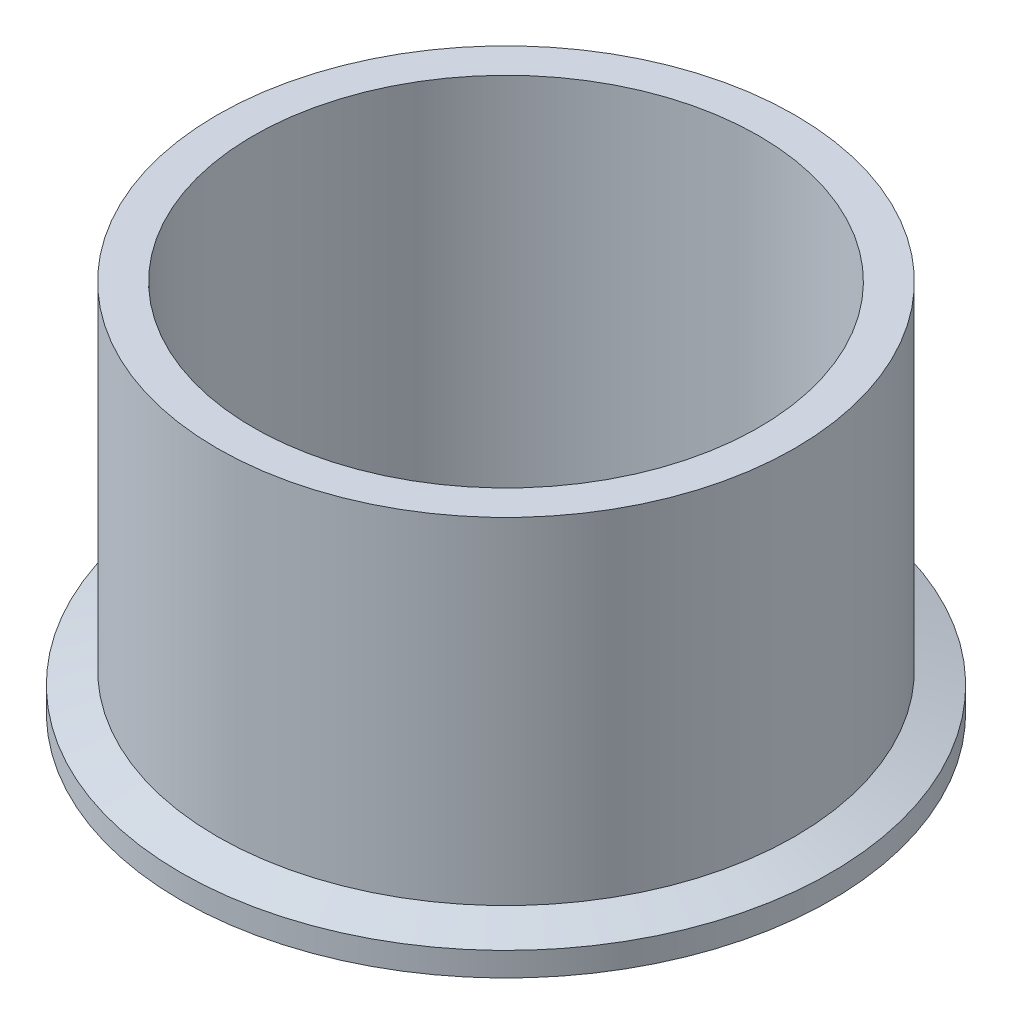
ISO-10303-21;
HEADER;
FILE_DESCRIPTION(('STEP AP214'),'2;1');
FILE_NAME('part.step','',(''),(''),'','','');
FILE_SCHEMA(('AUTOMOTIVE_DESIGN { 1 0 10303 214 1 1 1 1 }'));
ENDSEC;
DATA;
#1=APPLICATION_CONTEXT('core data for automotive mechanical design processes');
#2=APPLICATION_PROTOCOL_DEFINITION('international standard','automotive_design',2000,#1);
#3=PRODUCT_CONTEXT('',#1,'mechanical');
#4=PRODUCT('Part','Part','',(#3));
#5=PRODUCT_RELATED_PRODUCT_CATEGORY('part','',(#4));
#6=PRODUCT_DEFINITION_FORMATION('','',#4);
#7=PRODUCT_DEFINITION_CONTEXT('part definition',#1,'design');
#8=PRODUCT_DEFINITION('design','',#6,#7);
#9=PRODUCT_DEFINITION_SHAPE('','',#8);
#10=(LENGTH_UNIT() NAMED_UNIT(*) SI_UNIT(.MILLI.,.METRE.));
#11=(NAMED_UNIT(*) PLANE_ANGLE_UNIT() SI_UNIT($,.RADIAN.));
#12=(NAMED_UNIT(*) SI_UNIT($,.STERADIAN.) SOLID_ANGLE_UNIT());
#13=UNCERTAINTY_MEASURE_WITH_UNIT(LENGTH_MEASURE(1.E-05),#10,'distance_accuracy_value','');
#14=(GEOMETRIC_REPRESENTATION_CONTEXT(3) GLOBAL_UNCERTAINTY_ASSIGNED_CONTEXT((#13)) GLOBAL_UNIT_ASSIGNED_CONTEXT((#10,
#11,#12)) REPRESENTATION_CONTEXT('',''));
#15=CARTESIAN_POINT('',(0.,0.,0.));
#16=DIRECTION('',(0.,0.,1.));
#17=DIRECTION('',(1.,0.,0.));
#18=AXIS2_PLACEMENT_3D('',#15,#16,#17);
#19=CARTESIAN_POINT('',(0.,0.,0.));
#20=DIRECTION('',(0.,-1.,0.));
#21=DIRECTION('',(0.,0.,-1.));
#22=AXIS2_PLACEMENT_3D('',#19,#20,#21);
#23=CONICAL_SURFACE('',#22,36.788103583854,0.401425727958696);
#24=CARTESIAN_POINT('',(0.,0.872854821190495,0.));
#25=DIRECTION('',(0.,-1.,0.));
#26=DIRECTION('',(0.,0.,-1.));
#27=AXIS2_PLACEMENT_3D('',#24,#25,#26);
#28=CIRCLE('',#27,36.4175986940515);
#29=CARTESIAN_POINT('',(0.,0.872854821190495,-36.4175986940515));
#30=VERTEX_POINT('',#29);
#31=EDGE_CURVE('E10',#30,#30,#28,.T.);
#32=ORIENTED_EDGE('',*,*,#31,.F.);
#33=EDGE_LOOP('',(#32));
#34=FACE_BOUND('',#33,.T.);
#35=CARTESIAN_POINT('',(0.,0.,0.));
#36=DIRECTION('',(0.,-1.,0.));
#37=DIRECTION('',(0.,0.,-1.));
#38=AXIS2_PLACEMENT_3D('',#35,#36,#37);
#39=CIRCLE('',#38,36.788103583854);
#40=CARTESIAN_POINT('',(0.,0.,-36.788103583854));
#41=VERTEX_POINT('',#40);
#42=EDGE_CURVE('E67',#41,#41,#39,.T.);
#43=ORIENTED_EDGE('',*,*,#42,.T.);
#44=EDGE_LOOP('',(#43));
#45=FACE_BOUND('',#44,.T.);
#46=ADVANCED_FACE('F33',(#34,#45),#23,.F.);
#47=CARTESIAN_POINT('',(0.,0.4064,0.));
#48=DIRECTION('',(0.,-1.,0.));
#49=DIRECTION('',(0.,0.,-1.));
#50=AXIS2_PLACEMENT_3D('',#47,#48,#49);
#51=TOROIDAL_SURFACE('',#50,35.3187,1.1938);
#52=CARTESIAN_POINT('',(0.,0.762227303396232,0.));
#53=DIRECTION('',(0.,-1.,0.));
#54=DIRECTION('',(0.,0.,-1.));
#55=AXIS2_PLACEMENT_3D('',#52,#53,#54);
#56=CIRCLE('',#55,34.1791626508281);
#57=CARTESIAN_POINT('',(0.,0.762227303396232,-34.1791626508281));
#58=VERTEX_POINT('',#57);
#59=EDGE_CURVE('E39',#58,#58,#56,.T.);
#60=ORIENTED_EDGE('',*,*,#59,.F.);
#61=EDGE_LOOP('',(#60));
#62=FACE_BOUND('',#61,.T.);
#63=ORIENTED_EDGE('',*,*,#31,.T.);
#64=EDGE_LOOP('',(#63));
#65=FACE_BOUND('',#64,.T.);
#66=ADVANCED_FACE('F114',(#62,#65),#51,.F.);
#67=CARTESIAN_POINT('',(0.,0.762227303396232,0.));
#68=DIRECTION('',(0.,1.,0.));
#69=DIRECTION('',(0.,0.,1.));
#70=AXIS2_PLACEMENT_3D('',#67,#68,#69);
#71=CONICAL_SURFACE('',#70,34.1791626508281,0.401425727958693);
#72=CARTESIAN_POINT('',(0.,0.,0.));
#73=DIRECTION('',(0.,-1.,0.));
#74=DIRECTION('',(0.,0.,-1.));
#75=AXIS2_PLACEMENT_3D('',#72,#73,#74);
#76=CIRCLE('',#75,33.855616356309);
#77=CARTESIAN_POINT('',(0.,0.,-33.855616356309));
#78=VERTEX_POINT('',#77);
#79=EDGE_CURVE('E43',#78,#78,#76,.T.);
#80=ORIENTED_EDGE('',*,*,#79,.F.);
#81=EDGE_LOOP('',(#80));
#82=FACE_BOUND('',#81,.T.);
#83=ORIENTED_EDGE('',*,*,#59,.T.);
#84=EDGE_LOOP('',(#83));
#85=FACE_BOUND('',#84,.T.);
#86=ADVANCED_FACE('F110',(#82,#85),#71,.T.);
#87=CARTESIAN_POINT('',(0.,0.,0.));
#88=DIRECTION('',(0.,1.,0.));
#89=DIRECTION('',(0.,0.,1.));
#90=AXIS2_PLACEMENT_3D('',#87,#88,#89);
#91=PLANE('',#90);
#92=CARTESIAN_POINT('',(0.,0.,0.));
#93=DIRECTION('',(0.,-1.,0.));
#94=DIRECTION('',(0.,0.,-1.));
#95=AXIS2_PLACEMENT_3D('',#92,#93,#94);
#96=CIRCLE('',#95,30.099);
#97=CARTESIAN_POINT('',(0.,0.,-30.099));
#98=VERTEX_POINT('',#97);
#99=EDGE_CURVE('E47',#98,#98,#96,.T.);
#100=ORIENTED_EDGE('',*,*,#99,.F.);
#101=EDGE_LOOP('',(#100));
#102=FACE_BOUND('',#101,.T.);
#103=ORIENTED_EDGE('',*,*,#79,.T.);
#104=EDGE_LOOP('',(#103));
#105=FACE_BOUND('',#104,.T.);
#106=ADVANCED_FACE('F104',(#102,#105),#91,.F.);
#107=CARTESIAN_POINT('',(0.,0.,0.));
#108=DIRECTION('',(0.,-1.,0.));
#109=DIRECTION('',(0.,0.,-1.));
#110=AXIS2_PLACEMENT_3D('',#107,#108,#109);
#111=CYLINDRICAL_SURFACE('',#110,30.099);
#112=ORIENTED_EDGE('',*,*,#99,.T.);
#113=EDGE_LOOP('',(#112));
#114=FACE_BOUND('',#113,.T.);
#115=CARTESIAN_POINT('',(0.,44.45,0.));
#116=DIRECTION('',(0.,-1.,0.));
#117=DIRECTION('',(0.,0.,-1.));
#118=AXIS2_PLACEMENT_3D('',#115,#116,#117);
#119=CIRCLE('',#118,30.099);
#120=CARTESIAN_POINT('',(0.,44.45,-30.099));
#121=VERTEX_POINT('',#120);
#122=EDGE_CURVE('E52',#121,#121,#119,.T.);
#123=ORIENTED_EDGE('',*,*,#122,.F.);
#124=EDGE_LOOP('',(#123));
#125=FACE_BOUND('',#124,.T.);
#126=ADVANCED_FACE('F99',(#114,#125),#111,.F.);
#127=CARTESIAN_POINT('',(0.,44.45,0.));
#128=DIRECTION('',(0.,-1.,0.));
#129=DIRECTION('',(0.,0.,-1.));
#130=AXIS2_PLACEMENT_3D('',#127,#128,#129);
#131=PLANE('',#130);
#132=CARTESIAN_POINT('',(0.,44.45,0.));
#133=DIRECTION('',(0.,-1.,0.));
#134=DIRECTION('',(0.,0.,-1.));
#135=AXIS2_PLACEMENT_3D('',#132,#133,#134);
#136=CIRCLE('',#135,34.3916);
#137=CARTESIAN_POINT('',(0.,44.45,-34.3916));
#138=VERTEX_POINT('',#137);
#139=EDGE_CURVE('E55',#138,#138,#136,.T.);
#140=ORIENTED_EDGE('',*,*,#139,.F.);
#141=EDGE_LOOP('',(#140));
#142=FACE_BOUND('',#141,.T.);
#143=ORIENTED_EDGE('',*,*,#122,.T.);
#144=EDGE_LOOP('',(#143));
#145=FACE_BOUND('',#144,.T.);
#146=ADVANCED_FACE('F93',(#142,#145),#131,.F.);
#147=CARTESIAN_POINT('',(0.,0.,0.));
#148=DIRECTION('',(0.,-1.,0.));
#149=DIRECTION('',(0.,0.,-1.));
#150=AXIS2_PLACEMENT_3D('',#147,#148,#149);
#151=CYLINDRICAL_SURFACE('',#150,34.3916);
#152=CARTESIAN_POINT('',(0.,4.41642347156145,0.));
#153=DIRECTION('',(0.,-1.,0.));
#154=DIRECTION('',(0.,0.,-1.));
#155=AXIS2_PLACEMENT_3D('',#152,#153,#154);
#156=CIRCLE('',#155,34.3916);
#157=CARTESIAN_POINT('',(0.,4.41642347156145,-34.3916));
#158=VERTEX_POINT('',#157);
#159=EDGE_CURVE('E58',#158,#158,#156,.T.);
#160=ORIENTED_EDGE('',*,*,#159,.F.);
#161=EDGE_LOOP('',(#160));
#162=FACE_BOUND('',#161,.T.);
#163=ORIENTED_EDGE('',*,*,#139,.T.);
#164=EDGE_LOOP('',(#163));
#165=FACE_BOUND('',#164,.T.);
#166=ADVANCED_FACE('F87',(#162,#165),#151,.T.);
#167=CARTESIAN_POINT('',(0.,4.41642347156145,0.));
#168=DIRECTION('',(0.,-1.,0.));
#169=DIRECTION('',(0.,0.,-1.));
#170=AXIS2_PLACEMENT_3D('',#167,#168,#169);
#171=CONICAL_SURFACE('',#170,34.3916,1.22173047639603);
#172=CARTESIAN_POINT('',(0.,2.8448,0.));
#173=DIRECTION('',(0.,-1.,0.));
#174=DIRECTION('',(0.,0.,-1.));
#175=AXIS2_PLACEMENT_3D('',#172,#173,#174);
#176=CIRCLE('',#175,38.7096);
#177=CARTESIAN_POINT('',(0.,2.8448,-38.7096));
#178=VERTEX_POINT('',#177);
#179=EDGE_CURVE('E61',#178,#178,#176,.T.);
#180=ORIENTED_EDGE('',*,*,#179,.F.);
#181=EDGE_LOOP('',(#180));
#182=FACE_BOUND('',#181,.T.);
#183=ORIENTED_EDGE('',*,*,#159,.T.);
#184=EDGE_LOOP('',(#183));
#185=FACE_BOUND('',#184,.T.);
#186=ADVANCED_FACE('F81',(#182,#185),#171,.T.);
#187=CARTESIAN_POINT('',(0.,0.,0.));
#188=DIRECTION('',(0.,-1.,0.));
#189=DIRECTION('',(0.,0.,-1.));
#190=AXIS2_PLACEMENT_3D('',#187,#188,#189);
#191=CYLINDRICAL_SURFACE('',#190,38.7096);
#192=CARTESIAN_POINT('',(0.,0.,0.));
#193=DIRECTION('',(0.,-1.,0.));
#194=DIRECTION('',(0.,0.,-1.));
#195=AXIS2_PLACEMENT_3D('',#192,#193,#194);
#196=CIRCLE('',#195,38.7096);
#197=CARTESIAN_POINT('',(0.,0.,-38.7096));
#198=VERTEX_POINT('',#197);
#199=EDGE_CURVE('E64',#198,#198,#196,.T.);
#200=ORIENTED_EDGE('',*,*,#199,.F.);
#201=EDGE_LOOP('',(#200));
#202=FACE_BOUND('',#201,.T.);
#203=ORIENTED_EDGE('',*,*,#179,.T.);
#204=EDGE_LOOP('',(#203));
#205=FACE_BOUND('',#204,.T.);
#206=ADVANCED_FACE('F75',(#202,#205),#191,.T.);
#207=CARTESIAN_POINT('',(0.,0.,0.));
#208=DIRECTION('',(0.,1.,0.));
#209=DIRECTION('',(0.,0.,1.));
#210=AXIS2_PLACEMENT_3D('',#207,#208,#209);
#211=PLANE('',#210);
#212=ORIENTED_EDGE('',*,*,#42,.F.);
#213=EDGE_LOOP('',(#212));
#214=FACE_BOUND('',#213,.T.);
#215=ORIENTED_EDGE('',*,*,#199,.T.);
#216=EDGE_LOOP('',(#215));
#217=FACE_BOUND('',#216,.T.);
#218=ADVANCED_FACE('F72',(#214,#217),#211,.F.);
#219=CLOSED_SHELL('',(#46,#66,#86,#106,#126,#146,#166,#186,#206,#218));
#220=MANIFOLD_SOLID_BREP('B2',#219);
#221=ADVANCED_BREP_SHAPE_REPRESENTATION('',(#18,#220),#14);
#222=SHAPE_DEFINITION_REPRESENTATION(#9,#221);
ENDSEC;
END-ISO-10303-21;
